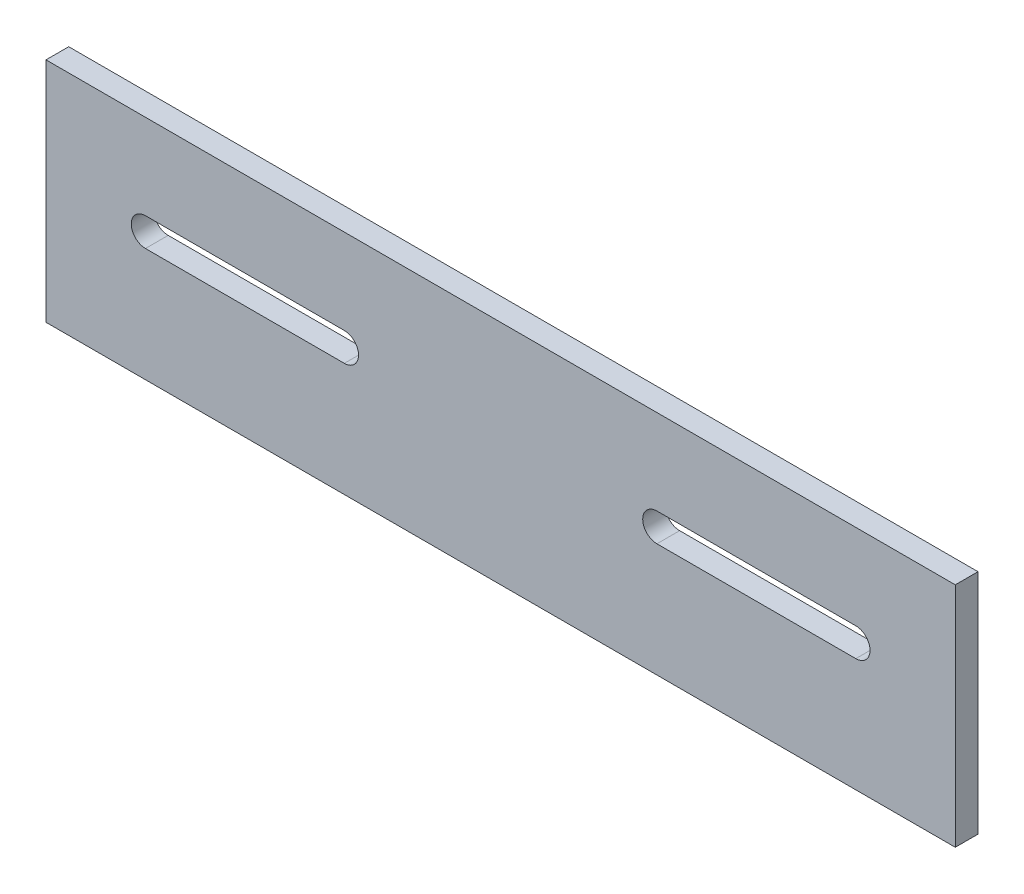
ISO-10303-21;
HEADER;
FILE_DESCRIPTION(('STEP AP214'),'2;1');
FILE_NAME('part.step','',(''),(''),'','','');
FILE_SCHEMA(('AUTOMOTIVE_DESIGN { 1 0 10303 214 1 1 1 1 }'));
ENDSEC;
DATA;
#1=APPLICATION_CONTEXT('core data for automotive mechanical design processes');
#2=APPLICATION_PROTOCOL_DEFINITION('international standard','automotive_design',2000,#1);
#3=PRODUCT_CONTEXT('',#1,'mechanical');
#4=PRODUCT('Part','Part','',(#3));
#5=PRODUCT_RELATED_PRODUCT_CATEGORY('part','',(#4));
#6=PRODUCT_DEFINITION_FORMATION('','',#4);
#7=PRODUCT_DEFINITION_CONTEXT('part definition',#1,'design');
#8=PRODUCT_DEFINITION('design','',#6,#7);
#9=PRODUCT_DEFINITION_SHAPE('','',#8);
#10=(LENGTH_UNIT() NAMED_UNIT(*) SI_UNIT(.MILLI.,.METRE.));
#11=(NAMED_UNIT(*) PLANE_ANGLE_UNIT() SI_UNIT($,.RADIAN.));
#12=(NAMED_UNIT(*) SI_UNIT($,.STERADIAN.) SOLID_ANGLE_UNIT());
#13=UNCERTAINTY_MEASURE_WITH_UNIT(LENGTH_MEASURE(1.E-05),#10,'distance_accuracy_value','');
#14=(GEOMETRIC_REPRESENTATION_CONTEXT(3) GLOBAL_UNCERTAINTY_ASSIGNED_CONTEXT((#13)) GLOBAL_UNIT_ASSIGNED_CONTEXT((#10,
#11,#12)) REPRESENTATION_CONTEXT('',''));
#15=CARTESIAN_POINT('',(0.,0.,0.));
#16=DIRECTION('',(0.,0.,1.));
#17=DIRECTION('',(1.,0.,0.));
#18=AXIS2_PLACEMENT_3D('',#15,#16,#17);
#19=CARTESIAN_POINT('',(-160.,40.,8.));
#20=DIRECTION('',(1.,0.,0.));
#21=DIRECTION('',(0.,0.,-1.));
#22=AXIS2_PLACEMENT_3D('',#19,#20,#21);
#23=PLANE('',#22);
#24=DIRECTION('',(0.,-1.,0.));
#25=VECTOR('',#24,1.);
#26=CARTESIAN_POINT('',(-160.,40.,0.));
#27=LINE('',#26,#25);
#28=CARTESIAN_POINT('',(-160.,40.,0.));
#29=VERTEX_POINT('',#28);
#30=CARTESIAN_POINT('',(-160.,-40.,0.));
#31=VERTEX_POINT('',#30);
#32=EDGE_CURVE('E189',#29,#31,#27,.T.);
#33=ORIENTED_EDGE('',*,*,#32,.T.);
#34=DIRECTION('',(0.,0.,-1.));
#35=VECTOR('',#34,1.);
#36=CARTESIAN_POINT('',(-160.,-40.,8.));
#37=LINE('',#36,#35);
#38=CARTESIAN_POINT('',(-160.,-40.,8.));
#39=VERTEX_POINT('',#38);
#40=EDGE_CURVE('E11',#39,#31,#37,.T.);
#41=ORIENTED_EDGE('',*,*,#40,.F.);
#42=DIRECTION('',(0.,-1.,0.));
#43=VECTOR('',#42,1.);
#44=CARTESIAN_POINT('',(-160.,40.,8.));
#45=LINE('',#44,#43);
#46=CARTESIAN_POINT('',(-160.,40.,8.));
#47=VERTEX_POINT('',#46);
#48=EDGE_CURVE('E196',#47,#39,#45,.T.);
#49=ORIENTED_EDGE('',*,*,#48,.F.);
#50=DIRECTION('',(0.,0.,-1.));
#51=VECTOR('',#50,1.);
#52=CARTESIAN_POINT('',(-160.,40.,8.));
#53=LINE('',#52,#51);
#54=EDGE_CURVE('E206',#47,#29,#53,.T.);
#55=ORIENTED_EDGE('',*,*,#54,.T.);
#56=EDGE_LOOP('',(#33,#41,#49,#55));
#57=FACE_BOUND('',#56,.T.);
#58=ADVANCED_FACE('F39',(#57),#23,.F.);
#59=CARTESIAN_POINT('',(-160.,-40.,8.));
#60=DIRECTION('',(0.,1.,0.));
#61=DIRECTION('',(0.,0.,1.));
#62=AXIS2_PLACEMENT_3D('',#59,#60,#61);
#63=PLANE('',#62);
#64=DIRECTION('',(1.,0.,0.));
#65=VECTOR('',#64,1.);
#66=CARTESIAN_POINT('',(-160.,-40.,0.));
#67=LINE('',#66,#65);
#68=CARTESIAN_POINT('',(160.,-40.,0.));
#69=VERTEX_POINT('',#68);
#70=EDGE_CURVE('E209',#31,#69,#67,.T.);
#71=ORIENTED_EDGE('',*,*,#70,.T.);
#72=DIRECTION('',(0.,0.,-1.));
#73=VECTOR('',#72,1.);
#74=CARTESIAN_POINT('',(160.,-40.,8.));
#75=LINE('',#74,#73);
#76=CARTESIAN_POINT('',(160.,-40.,8.));
#77=VERTEX_POINT('',#76);
#78=EDGE_CURVE('E46',#77,#69,#75,.T.);
#79=ORIENTED_EDGE('',*,*,#78,.F.);
#80=DIRECTION('',(1.,0.,0.));
#81=VECTOR('',#80,1.);
#82=CARTESIAN_POINT('',(-160.,-40.,8.));
#83=LINE('',#82,#81);
#84=EDGE_CURVE('E199',#39,#77,#83,.T.);
#85=ORIENTED_EDGE('',*,*,#84,.F.);
#86=ORIENTED_EDGE('',*,*,#40,.T.);
#87=EDGE_LOOP('',(#71,#79,#85,#86));
#88=FACE_BOUND('',#87,.T.);
#89=ADVANCED_FACE('F238',(#88),#63,.F.);
#90=CARTESIAN_POINT('',(160.,40.,8.));
#91=DIRECTION('',(-1.,0.,0.));
#92=DIRECTION('',(0.,-1.,0.));
#93=AXIS2_PLACEMENT_3D('',#90,#91,#92);
#94=PLANE('',#93);
#95=DIRECTION('',(0.,1.,0.));
#96=VECTOR('',#95,1.);
#97=CARTESIAN_POINT('',(160.,40.,0.));
#98=LINE('',#97,#96);
#99=CARTESIAN_POINT('',(160.,40.,0.));
#100=VERTEX_POINT('',#99);
#101=EDGE_CURVE('E211',#69,#100,#98,.T.);
#102=ORIENTED_EDGE('',*,*,#101,.T.);
#103=DIRECTION('',(0.,0.,-1.));
#104=VECTOR('',#103,1.);
#105=CARTESIAN_POINT('',(160.,40.,8.));
#106=LINE('',#105,#104);
#107=CARTESIAN_POINT('',(160.,40.,8.));
#108=VERTEX_POINT('',#107);
#109=EDGE_CURVE('E216',#108,#100,#106,.T.);
#110=ORIENTED_EDGE('',*,*,#109,.F.);
#111=DIRECTION('',(0.,1.,0.));
#112=VECTOR('',#111,1.);
#113=CARTESIAN_POINT('',(160.,40.,8.));
#114=LINE('',#113,#112);
#115=EDGE_CURVE('E202',#77,#108,#114,.T.);
#116=ORIENTED_EDGE('',*,*,#115,.F.);
#117=ORIENTED_EDGE('',*,*,#78,.T.);
#118=EDGE_LOOP('',(#102,#110,#116,#117));
#119=FACE_BOUND('',#118,.T.);
#120=ADVANCED_FACE('F223',(#119),#94,.F.);
#121=CARTESIAN_POINT('',(-160.,40.,8.));
#122=DIRECTION('',(0.,-1.,0.));
#123=DIRECTION('',(0.,0.,-1.));
#124=AXIS2_PLACEMENT_3D('',#121,#122,#123);
#125=PLANE('',#124);
#126=DIRECTION('',(-1.,0.,0.));
#127=VECTOR('',#126,1.);
#128=CARTESIAN_POINT('',(-160.,40.,0.));
#129=LINE('',#128,#127);
#130=EDGE_CURVE('E200',#100,#29,#129,.T.);
#131=ORIENTED_EDGE('',*,*,#130,.T.);
#132=ORIENTED_EDGE('',*,*,#54,.F.);
#133=DIRECTION('',(-1.,0.,0.));
#134=VECTOR('',#133,1.);
#135=CARTESIAN_POINT('',(-160.,40.,8.));
#136=LINE('',#135,#134);
#137=EDGE_CURVE('E204',#108,#47,#136,.T.);
#138=ORIENTED_EDGE('',*,*,#137,.F.);
#139=ORIENTED_EDGE('',*,*,#109,.T.);
#140=EDGE_LOOP('',(#131,#132,#138,#139));
#141=FACE_BOUND('',#140,.T.);
#142=ADVANCED_FACE('F231',(#141),#125,.F.);
#143=CARTESIAN_POINT('',(-160.,-40.,8.));
#144=DIRECTION('',(0.,0.,1.));
#145=DIRECTION('',(1.,0.,0.));
#146=AXIS2_PLACEMENT_3D('',#143,#144,#145);
#147=PLANE('',#146);
#148=CARTESIAN_POINT('',(55.,5.,8.));
#149=DIRECTION('',(0.,0.,1.));
#150=DIRECTION('',(1.,0.,0.));
#151=AXIS2_PLACEMENT_3D('',#148,#149,#150);
#152=CIRCLE('',#151,5.);
#153=CARTESIAN_POINT('',(55.,10.,8.));
#154=VERTEX_POINT('',#153);
#155=CARTESIAN_POINT('',(55.,0.,8.));
#156=VERTEX_POINT('',#155);
#157=EDGE_CURVE('E53',#154,#156,#152,.T.);
#158=ORIENTED_EDGE('',*,*,#157,.F.);
#159=DIRECTION('',(-1.,0.,0.));
#160=VECTOR('',#159,1.);
#161=CARTESIAN_POINT('',(55.,10.,8.));
#162=LINE('',#161,#160);
#163=CARTESIAN_POINT('',(125.,10.,8.));
#164=VERTEX_POINT('',#163);
#165=EDGE_CURVE('E145',#164,#154,#162,.T.);
#166=ORIENTED_EDGE('',*,*,#165,.F.);
#167=CARTESIAN_POINT('',(125.,5.,8.));
#168=DIRECTION('',(0.,0.,1.));
#169=DIRECTION('',(1.,0.,0.));
#170=AXIS2_PLACEMENT_3D('',#167,#168,#169);
#171=CIRCLE('',#170,5.00000000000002);
#172=CARTESIAN_POINT('',(125.,0.,8.));
#173=VERTEX_POINT('',#172);
#174=EDGE_CURVE('E148',#173,#164,#171,.T.);
#175=ORIENTED_EDGE('',*,*,#174,.F.);
#176=DIRECTION('',(1.,0.,0.));
#177=VECTOR('',#176,1.);
#178=CARTESIAN_POINT('',(55.,0.,8.));
#179=LINE('',#178,#177);
#180=EDGE_CURVE('E154',#156,#173,#179,.T.);
#181=ORIENTED_EDGE('',*,*,#180,.F.);
#182=EDGE_LOOP('',(#158,#166,#175,#181));
#183=FACE_BOUND('',#182,.T.);
#184=CARTESIAN_POINT('',(-125.,5.,8.));
#185=DIRECTION('',(0.,0.,1.));
#186=DIRECTION('',(1.,0.,0.));
#187=AXIS2_PLACEMENT_3D('',#184,#185,#186);
#188=CIRCLE('',#187,4.99999999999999);
#189=CARTESIAN_POINT('',(-125.,9.99999999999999,8.));
#190=VERTEX_POINT('',#189);
#191=CARTESIAN_POINT('',(-125.,0.,8.));
#192=VERTEX_POINT('',#191);
#193=EDGE_CURVE('E160',#190,#192,#188,.T.);
#194=ORIENTED_EDGE('',*,*,#193,.F.);
#195=DIRECTION('',(-1.,0.,0.));
#196=VECTOR('',#195,1.);
#197=CARTESIAN_POINT('',(-125.,9.99999999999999,8.));
#198=LINE('',#197,#196);
#199=CARTESIAN_POINT('',(-55.,10.,8.));
#200=VERTEX_POINT('',#199);
#201=EDGE_CURVE('E168',#200,#190,#198,.T.);
#202=ORIENTED_EDGE('',*,*,#201,.F.);
#203=CARTESIAN_POINT('',(-55.,5.,8.));
#204=DIRECTION('',(0.,0.,1.));
#205=DIRECTION('',(1.,0.,0.));
#206=AXIS2_PLACEMENT_3D('',#203,#204,#205);
#207=CIRCLE('',#206,5.);
#208=CARTESIAN_POINT('',(-55.,0.,8.));
#209=VERTEX_POINT('',#208);
#210=EDGE_CURVE('E182',#209,#200,#207,.T.);
#211=ORIENTED_EDGE('',*,*,#210,.F.);
#212=DIRECTION('',(1.,0.,0.));
#213=VECTOR('',#212,1.);
#214=CARTESIAN_POINT('',(-125.,0.,8.));
#215=LINE('',#214,#213);
#216=EDGE_CURVE('E179',#192,#209,#215,.T.);
#217=ORIENTED_EDGE('',*,*,#216,.F.);
#218=EDGE_LOOP('',(#194,#202,#211,#217));
#219=FACE_BOUND('',#218,.T.);
#220=ORIENTED_EDGE('',*,*,#48,.T.);
#221=ORIENTED_EDGE('',*,*,#84,.T.);
#222=ORIENTED_EDGE('',*,*,#115,.T.);
#223=ORIENTED_EDGE('',*,*,#137,.T.);
#224=EDGE_LOOP('',(#220,#221,#222,#223));
#225=FACE_BOUND('',#224,.T.);
#226=ADVANCED_FACE('F237',(#183,#219,#225),#147,.T.);
#227=CARTESIAN_POINT('',(-160.,-40.,0.));
#228=DIRECTION('',(0.,0.,1.));
#229=DIRECTION('',(1.,0.,0.));
#230=AXIS2_PLACEMENT_3D('',#227,#228,#229);
#231=PLANE('',#230);
#232=DIRECTION('',(-1.,0.,0.));
#233=VECTOR('',#232,1.);
#234=CARTESIAN_POINT('',(55.,10.,0.));
#235=LINE('',#234,#233);
#236=CARTESIAN_POINT('',(125.,10.,0.));
#237=VERTEX_POINT('',#236);
#238=CARTESIAN_POINT('',(55.,10.,0.));
#239=VERTEX_POINT('',#238);
#240=EDGE_CURVE('E135',#237,#239,#235,.T.);
#241=ORIENTED_EDGE('',*,*,#240,.T.);
#242=CARTESIAN_POINT('',(55.,5.,0.));
#243=DIRECTION('',(0.,0.,1.));
#244=DIRECTION('',(1.,0.,0.));
#245=AXIS2_PLACEMENT_3D('',#242,#243,#244);
#246=CIRCLE('',#245,5.);
#247=CARTESIAN_POINT('',(55.,0.,0.));
#248=VERTEX_POINT('',#247);
#249=EDGE_CURVE('E129',#239,#248,#246,.T.);
#250=ORIENTED_EDGE('',*,*,#249,.T.);
#251=DIRECTION('',(1.,0.,0.));
#252=VECTOR('',#251,1.);
#253=CARTESIAN_POINT('',(55.,0.,0.));
#254=LINE('',#253,#252);
#255=CARTESIAN_POINT('',(125.,0.,0.));
#256=VERTEX_POINT('',#255);
#257=EDGE_CURVE('E138',#248,#256,#254,.T.);
#258=ORIENTED_EDGE('',*,*,#257,.T.);
#259=CARTESIAN_POINT('',(125.,5.,0.));
#260=DIRECTION('',(0.,0.,1.));
#261=DIRECTION('',(1.,0.,0.));
#262=AXIS2_PLACEMENT_3D('',#259,#260,#261);
#263=CIRCLE('',#262,5.00000000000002);
#264=EDGE_CURVE('E61',#256,#237,#263,.T.);
#265=ORIENTED_EDGE('',*,*,#264,.T.);
#266=EDGE_LOOP('',(#241,#250,#258,#265));
#267=FACE_BOUND('',#266,.T.);
#268=DIRECTION('',(-1.,0.,0.));
#269=VECTOR('',#268,1.);
#270=CARTESIAN_POINT('',(-125.,9.99999999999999,0.));
#271=LINE('',#270,#269);
#272=CARTESIAN_POINT('',(-55.,10.,0.));
#273=VERTEX_POINT('',#272);
#274=CARTESIAN_POINT('',(-125.,9.99999999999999,0.));
#275=VERTEX_POINT('',#274);
#276=EDGE_CURVE('E174',#273,#275,#271,.T.);
#277=ORIENTED_EDGE('',*,*,#276,.T.);
#278=CARTESIAN_POINT('',(-125.,5.,0.));
#279=DIRECTION('',(0.,0.,1.));
#280=DIRECTION('',(1.,0.,0.));
#281=AXIS2_PLACEMENT_3D('',#278,#279,#280);
#282=CIRCLE('',#281,4.99999999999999);
#283=CARTESIAN_POINT('',(-125.,0.,0.));
#284=VERTEX_POINT('',#283);
#285=EDGE_CURVE('E164',#275,#284,#282,.T.);
#286=ORIENTED_EDGE('',*,*,#285,.T.);
#287=DIRECTION('',(1.,0.,0.));
#288=VECTOR('',#287,1.);
#289=CARTESIAN_POINT('',(-125.,0.,0.));
#290=LINE('',#289,#288);
#291=CARTESIAN_POINT('',(-55.,0.,0.));
#292=VERTEX_POINT('',#291);
#293=EDGE_CURVE('E167',#284,#292,#290,.T.);
#294=ORIENTED_EDGE('',*,*,#293,.T.);
#295=CARTESIAN_POINT('',(-55.,5.,0.));
#296=DIRECTION('',(0.,0.,1.));
#297=DIRECTION('',(1.,0.,0.));
#298=AXIS2_PLACEMENT_3D('',#295,#296,#297);
#299=CIRCLE('',#298,5.);
#300=EDGE_CURVE('E171',#292,#273,#299,.T.);
#301=ORIENTED_EDGE('',*,*,#300,.T.);
#302=EDGE_LOOP('',(#277,#286,#294,#301));
#303=FACE_BOUND('',#302,.T.);
#304=ORIENTED_EDGE('',*,*,#32,.F.);
#305=ORIENTED_EDGE('',*,*,#130,.F.);
#306=ORIENTED_EDGE('',*,*,#101,.F.);
#307=ORIENTED_EDGE('',*,*,#70,.F.);
#308=EDGE_LOOP('',(#304,#305,#306,#307));
#309=FACE_BOUND('',#308,.T.);
#310=ADVANCED_FACE('F142',(#267,#303,#309),#231,.F.);
#311=CARTESIAN_POINT('',(-125.,5.,0.));
#312=DIRECTION('',(0.,0.,1.));
#313=DIRECTION('',(1.,0.,0.));
#314=AXIS2_PLACEMENT_3D('',#311,#312,#313);
#315=CYLINDRICAL_SURFACE('',#314,4.99999999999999);
#316=ORIENTED_EDGE('',*,*,#193,.T.);
#317=DIRECTION('',(0.,0.,1.));
#318=VECTOR('',#317,1.);
#319=CARTESIAN_POINT('',(-125.,0.,0.));
#320=LINE('',#319,#318);
#321=EDGE_CURVE('E177',#284,#192,#320,.T.);
#322=ORIENTED_EDGE('',*,*,#321,.F.);
#323=ORIENTED_EDGE('',*,*,#285,.F.);
#324=DIRECTION('',(0.,0.,1.));
#325=VECTOR('',#324,1.);
#326=CARTESIAN_POINT('',(-125.,9.99999999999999,0.));
#327=LINE('',#326,#325);
#328=EDGE_CURVE('E187',#275,#190,#327,.T.);
#329=ORIENTED_EDGE('',*,*,#328,.T.);
#330=EDGE_LOOP('',(#316,#322,#323,#329));
#331=FACE_BOUND('',#330,.T.);
#332=ADVANCED_FACE('F250',(#331),#315,.F.);
#333=CARTESIAN_POINT('',(-125.,9.99999999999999,0.));
#334=DIRECTION('',(0.,1.,0.));
#335=DIRECTION('',(-1.,0.,0.));
#336=AXIS2_PLACEMENT_3D('',#333,#334,#335);
#337=PLANE('',#336);
#338=ORIENTED_EDGE('',*,*,#201,.T.);
#339=ORIENTED_EDGE('',*,*,#328,.F.);
#340=ORIENTED_EDGE('',*,*,#276,.F.);
#341=DIRECTION('',(0.,0.,1.));
#342=VECTOR('',#341,1.);
#343=CARTESIAN_POINT('',(-55.,10.,0.));
#344=LINE('',#343,#342);
#345=EDGE_CURVE('E190',#273,#200,#344,.T.);
#346=ORIENTED_EDGE('',*,*,#345,.T.);
#347=EDGE_LOOP('',(#338,#339,#340,#346));
#348=FACE_BOUND('',#347,.T.);
#349=ADVANCED_FACE('F256',(#348),#337,.F.);
#350=CARTESIAN_POINT('',(-55.,5.,0.));
#351=DIRECTION('',(0.,0.,1.));
#352=DIRECTION('',(1.,0.,0.));
#353=AXIS2_PLACEMENT_3D('',#350,#351,#352);
#354=CYLINDRICAL_SURFACE('',#353,5.);
#355=ORIENTED_EDGE('',*,*,#210,.T.);
#356=ORIENTED_EDGE('',*,*,#345,.F.);
#357=ORIENTED_EDGE('',*,*,#300,.F.);
#358=DIRECTION('',(0.,0.,1.));
#359=VECTOR('',#358,1.);
#360=CARTESIAN_POINT('',(-55.,0.,0.));
#361=LINE('',#360,#359);
#362=EDGE_CURVE('E192',#292,#209,#361,.T.);
#363=ORIENTED_EDGE('',*,*,#362,.T.);
#364=EDGE_LOOP('',(#355,#356,#357,#363));
#365=FACE_BOUND('',#364,.T.);
#366=ADVANCED_FACE('F261',(#365),#354,.F.);
#367=CARTESIAN_POINT('',(-125.,0.,0.));
#368=DIRECTION('',(0.,-1.,0.));
#369=DIRECTION('',(1.,0.,0.));
#370=AXIS2_PLACEMENT_3D('',#367,#368,#369);
#371=PLANE('',#370);
#372=ORIENTED_EDGE('',*,*,#216,.T.);
#373=ORIENTED_EDGE('',*,*,#362,.F.);
#374=ORIENTED_EDGE('',*,*,#293,.F.);
#375=ORIENTED_EDGE('',*,*,#321,.T.);
#376=EDGE_LOOP('',(#372,#373,#374,#375));
#377=FACE_BOUND('',#376,.T.);
#378=ADVANCED_FACE('F258',(#377),#371,.F.);
#379=CARTESIAN_POINT('',(55.,5.,0.));
#380=DIRECTION('',(0.,0.,1.));
#381=DIRECTION('',(1.,0.,0.));
#382=AXIS2_PLACEMENT_3D('',#379,#380,#381);
#383=CYLINDRICAL_SURFACE('',#382,5.);
#384=ORIENTED_EDGE('',*,*,#157,.T.);
#385=DIRECTION('',(0.,0.,1.));
#386=VECTOR('',#385,1.);
#387=CARTESIAN_POINT('',(55.,0.,0.));
#388=LINE('',#387,#386);
#389=EDGE_CURVE('E125',#248,#156,#388,.T.);
#390=ORIENTED_EDGE('',*,*,#389,.F.);
#391=ORIENTED_EDGE('',*,*,#249,.F.);
#392=DIRECTION('',(0.,0.,1.));
#393=VECTOR('',#392,1.);
#394=CARTESIAN_POINT('',(55.,10.,0.));
#395=LINE('',#394,#393);
#396=EDGE_CURVE('E158',#239,#154,#395,.T.);
#397=ORIENTED_EDGE('',*,*,#396,.T.);
#398=EDGE_LOOP('',(#384,#390,#391,#397));
#399=FACE_BOUND('',#398,.T.);
#400=ADVANCED_FACE('F127',(#399),#383,.F.);
#401=CARTESIAN_POINT('',(55.,10.,0.));
#402=DIRECTION('',(0.,1.,0.));
#403=DIRECTION('',(-1.,0.,0.));
#404=AXIS2_PLACEMENT_3D('',#401,#402,#403);
#405=PLANE('',#404);
#406=ORIENTED_EDGE('',*,*,#165,.T.);
#407=ORIENTED_EDGE('',*,*,#396,.F.);
#408=ORIENTED_EDGE('',*,*,#240,.F.);
#409=DIRECTION('',(0.,0.,1.));
#410=VECTOR('',#409,1.);
#411=CARTESIAN_POINT('',(125.,10.,0.));
#412=LINE('',#411,#410);
#413=EDGE_CURVE('E161',#237,#164,#412,.T.);
#414=ORIENTED_EDGE('',*,*,#413,.T.);
#415=EDGE_LOOP('',(#406,#407,#408,#414));
#416=FACE_BOUND('',#415,.T.);
#417=ADVANCED_FACE('F271',(#416),#405,.F.);
#418=CARTESIAN_POINT('',(125.,5.,0.));
#419=DIRECTION('',(0.,0.,1.));
#420=DIRECTION('',(1.,0.,0.));
#421=AXIS2_PLACEMENT_3D('',#418,#419,#420);
#422=CYLINDRICAL_SURFACE('',#421,5.00000000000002);
#423=ORIENTED_EDGE('',*,*,#174,.T.);
#424=ORIENTED_EDGE('',*,*,#413,.F.);
#425=ORIENTED_EDGE('',*,*,#264,.F.);
#426=DIRECTION('',(0.,0.,1.));
#427=VECTOR('',#426,1.);
#428=CARTESIAN_POINT('',(125.,0.,0.));
#429=LINE('',#428,#427);
#430=EDGE_CURVE('E134',#256,#173,#429,.T.);
#431=ORIENTED_EDGE('',*,*,#430,.T.);
#432=EDGE_LOOP('',(#423,#424,#425,#431));
#433=FACE_BOUND('',#432,.T.);
#434=ADVANCED_FACE('F274',(#433),#422,.F.);
#435=CARTESIAN_POINT('',(55.,0.,0.));
#436=DIRECTION('',(0.,-1.,0.));
#437=DIRECTION('',(1.,0.,0.));
#438=AXIS2_PLACEMENT_3D('',#435,#436,#437);
#439=PLANE('',#438);
#440=ORIENTED_EDGE('',*,*,#180,.T.);
#441=ORIENTED_EDGE('',*,*,#430,.F.);
#442=ORIENTED_EDGE('',*,*,#257,.F.);
#443=ORIENTED_EDGE('',*,*,#389,.T.);
#444=EDGE_LOOP('',(#440,#441,#442,#443));
#445=FACE_BOUND('',#444,.T.);
#446=ADVANCED_FACE('F139',(#445),#439,.F.);
#447=CLOSED_SHELL('',(#58,#89,#120,#142,#226,#310,#332,#349,#366,#378,#400,#417,#434,#446));
#448=MANIFOLD_SOLID_BREP('B2',#447);
#449=ADVANCED_BREP_SHAPE_REPRESENTATION('',(#18,#448),#14);
#450=SHAPE_DEFINITION_REPRESENTATION(#9,#449);
ENDSEC;
END-ISO-10303-21;
